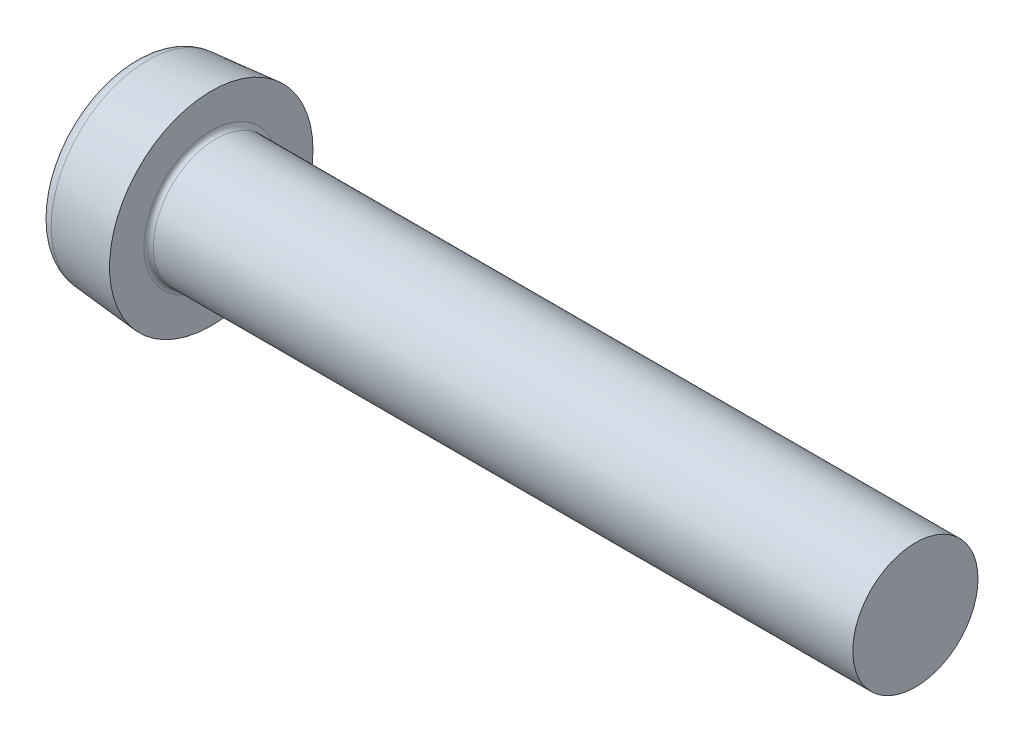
ISO-10303-21;
HEADER;
FILE_DESCRIPTION(('STEP AP214'),'2;1');
FILE_NAME('part.step','',(''),(''),'','','');
FILE_SCHEMA(('AUTOMOTIVE_DESIGN { 1 0 10303 214 1 1 1 1 }'));
ENDSEC;
DATA;
#1=APPLICATION_CONTEXT('core data for automotive mechanical design processes');
#2=APPLICATION_PROTOCOL_DEFINITION('international standard','automotive_design',2000,#1);
#3=PRODUCT_CONTEXT('',#1,'mechanical');
#4=PRODUCT('Part','Part','',(#3));
#5=PRODUCT_RELATED_PRODUCT_CATEGORY('part','',(#4));
#6=PRODUCT_DEFINITION_FORMATION('','',#4);
#7=PRODUCT_DEFINITION_CONTEXT('part definition',#1,'design');
#8=PRODUCT_DEFINITION('design','',#6,#7);
#9=PRODUCT_DEFINITION_SHAPE('','',#8);
#10=(LENGTH_UNIT() NAMED_UNIT(*) SI_UNIT(.MILLI.,.METRE.));
#11=(NAMED_UNIT(*) PLANE_ANGLE_UNIT() SI_UNIT($,.RADIAN.));
#12=(NAMED_UNIT(*) SI_UNIT($,.STERADIAN.) SOLID_ANGLE_UNIT());
#13=UNCERTAINTY_MEASURE_WITH_UNIT(LENGTH_MEASURE(1.E-05),#10,'distance_accuracy_value','');
#14=(GEOMETRIC_REPRESENTATION_CONTEXT(3) GLOBAL_UNCERTAINTY_ASSIGNED_CONTEXT((#13)) GLOBAL_UNIT_ASSIGNED_CONTEXT((#10,
#11,#12)) REPRESENTATION_CONTEXT('',''));
#15=CARTESIAN_POINT('',(0.,0.,0.));
#16=DIRECTION('',(0.,0.,1.));
#17=DIRECTION('',(1.,0.,0.));
#18=AXIS2_PLACEMENT_3D('',#15,#16,#17);
#19=CARTESIAN_POINT('',(0.,0.,0.));
#20=DIRECTION('',(-1.,0.,0.));
#21=DIRECTION('',(0.,0.,1.));
#22=AXIS2_PLACEMENT_3D('',#19,#20,#21);
#23=PLANE('',#22);
#24=CARTESIAN_POINT('',(0.,0.,0.));
#25=DIRECTION('',(-1.,0.,0.));
#26=DIRECTION('',(0.,0.,1.));
#27=AXIS2_PLACEMENT_3D('',#24,#25,#26);
#28=CIRCLE('',#27,5.14622550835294);
#29=CARTESIAN_POINT('',(0.,0.,5.14622550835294));
#30=VERTEX_POINT('',#29);
#31=EDGE_CURVE('E364',#30,#30,#28,.T.);
#32=ORIENTED_EDGE('',*,*,#31,.T.);
#33=EDGE_LOOP('',(#32));
#34=FACE_BOUND('',#33,.T.);
#35=DIRECTION('',(0.,0.,1.));
#36=VECTOR('',#35,1.);
#37=CARTESIAN_POINT('',(0.,0.77,-0.77));
#38=LINE('',#37,#36);
#39=CARTESIAN_POINT('',(0.,0.77,-3.85));
#40=VERTEX_POINT('',#39);
#41=CARTESIAN_POINT('',(0.,0.77,-1.81196017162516));
#42=VERTEX_POINT('',#41);
#43=EDGE_CURVE('E221',#40,#42,#38,.T.);
#44=ORIENTED_EDGE('',*,*,#43,.T.);
#45=DIRECTION('',(0.,0.906307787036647,-0.422618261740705));
#46=VECTOR('',#45,1.);
#47=CARTESIAN_POINT('',(0.,2.72236110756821,-2.72236110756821));
#48=LINE('',#47,#46);
#49=CARTESIAN_POINT('',(0.,2.72236110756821,-2.72236110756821));
#50=VERTEX_POINT('',#49);
#51=EDGE_CURVE('E201',#42,#50,#48,.T.);
#52=ORIENTED_EDGE('',*,*,#51,.T.);
#53=DIRECTION('',(0.,-0.422618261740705,0.906307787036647));
#54=VECTOR('',#53,1.);
#55=CARTESIAN_POINT('',(0.,2.72236110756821,-2.72236110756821));
#56=LINE('',#55,#54);
#57=CARTESIAN_POINT('',(0.,1.81196017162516,-0.77));
#58=VERTEX_POINT('',#57);
#59=EDGE_CURVE('E211',#50,#58,#56,.T.);
#60=ORIENTED_EDGE('',*,*,#59,.T.);
#61=DIRECTION('',(0.,1.,0.));
#62=VECTOR('',#61,1.);
#63=CARTESIAN_POINT('',(0.,0.77,-0.77));
#64=LINE('',#63,#62);
#65=CARTESIAN_POINT('',(0.,3.85,-0.77));
#66=VERTEX_POINT('',#65);
#67=EDGE_CURVE('E312',#58,#66,#64,.T.);
#68=ORIENTED_EDGE('',*,*,#67,.T.);
#69=DIRECTION('',(0.,0.,1.));
#70=VECTOR('',#69,1.);
#71=CARTESIAN_POINT('',(0.,3.85,-0.77));
#72=LINE('',#71,#70);
#73=CARTESIAN_POINT('',(0.,3.85,0.770000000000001));
#74=VERTEX_POINT('',#73);
#75=EDGE_CURVE('E314',#66,#74,#72,.T.);
#76=ORIENTED_EDGE('',*,*,#75,.T.);
#77=DIRECTION('',(0.,-1.,0.));
#78=VECTOR('',#77,1.);
#79=CARTESIAN_POINT('',(0.,0.77,0.77));
#80=LINE('',#79,#78);
#81=CARTESIAN_POINT('',(0.,1.81196017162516,0.77));
#82=VERTEX_POINT('',#81);
#83=EDGE_CURVE('E269',#74,#82,#80,.T.);
#84=ORIENTED_EDGE('',*,*,#83,.T.);
#85=DIRECTION('',(0.,0.422618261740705,0.906307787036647));
#86=VECTOR('',#85,1.);
#87=CARTESIAN_POINT('',(0.,2.72236110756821,2.72236110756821));
#88=LINE('',#87,#86);
#89=CARTESIAN_POINT('',(0.,2.72236110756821,2.72236110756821));
#90=VERTEX_POINT('',#89);
#91=EDGE_CURVE('E216',#82,#90,#88,.T.);
#92=ORIENTED_EDGE('',*,*,#91,.T.);
#93=DIRECTION('',(0.,-0.906307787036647,-0.422618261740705));
#94=VECTOR('',#93,1.);
#95=CARTESIAN_POINT('',(0.,2.72236110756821,2.72236110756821));
#96=LINE('',#95,#94);
#97=CARTESIAN_POINT('',(0.,0.77,1.81196017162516));
#98=VERTEX_POINT('',#97);
#99=EDGE_CURVE('E226',#90,#98,#96,.T.);
#100=ORIENTED_EDGE('',*,*,#99,.T.);
#101=DIRECTION('',(0.,0.,1.));
#102=VECTOR('',#101,1.);
#103=CARTESIAN_POINT('',(0.,0.77,0.77));
#104=LINE('',#103,#102);
#105=CARTESIAN_POINT('',(0.,0.769999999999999,3.85));
#106=VERTEX_POINT('',#105);
#107=EDGE_CURVE('E265',#98,#106,#104,.T.);
#108=ORIENTED_EDGE('',*,*,#107,.T.);
#109=DIRECTION('',(0.,-1.,0.));
#110=VECTOR('',#109,1.);
#111=CARTESIAN_POINT('',(0.,0.769999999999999,3.85));
#112=LINE('',#111,#110);
#113=CARTESIAN_POINT('',(0.,-0.770000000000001,3.85));
#114=VERTEX_POINT('',#113);
#115=EDGE_CURVE('E293',#106,#114,#112,.T.);
#116=ORIENTED_EDGE('',*,*,#115,.T.);
#117=DIRECTION('',(0.,0.,-1.));
#118=VECTOR('',#117,1.);
#119=CARTESIAN_POINT('',(0.,-0.77,0.769999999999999));
#120=LINE('',#119,#118);
#121=CARTESIAN_POINT('',(0.,-0.770000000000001,1.81196017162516));
#122=VERTEX_POINT('',#121);
#123=EDGE_CURVE('E296',#114,#122,#120,.T.);
#124=ORIENTED_EDGE('',*,*,#123,.T.);
#125=DIRECTION('',(0.,-0.906307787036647,0.422618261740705));
#126=VECTOR('',#125,1.);
#127=CARTESIAN_POINT('',(0.,-2.72236110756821,2.72236110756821));
#128=LINE('',#127,#126);
#129=CARTESIAN_POINT('',(0.,-2.72236110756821,2.72236110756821));
#130=VERTEX_POINT('',#129);
#131=EDGE_CURVE('E229',#122,#130,#128,.T.);
#132=ORIENTED_EDGE('',*,*,#131,.T.);
#133=DIRECTION('',(0.,0.422618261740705,-0.906307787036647));
#134=VECTOR('',#133,1.);
#135=CARTESIAN_POINT('',(0.,-2.72236110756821,2.72236110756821));
#136=LINE('',#135,#134);
#137=CARTESIAN_POINT('',(0.,-1.81196017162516,0.769999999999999));
#138=VERTEX_POINT('',#137);
#139=EDGE_CURVE('E232',#130,#138,#136,.T.);
#140=ORIENTED_EDGE('',*,*,#139,.T.);
#141=DIRECTION('',(0.,-1.,0.));
#142=VECTOR('',#141,1.);
#143=CARTESIAN_POINT('',(0.,-0.77,0.769999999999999));
#144=LINE('',#143,#142);
#145=CARTESIAN_POINT('',(0.,-3.85,0.769999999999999));
#146=VERTEX_POINT('',#145);
#147=EDGE_CURVE('E299',#138,#146,#144,.T.);
#148=ORIENTED_EDGE('',*,*,#147,.T.);
#149=DIRECTION('',(0.,0.,-1.));
#150=VECTOR('',#149,1.);
#151=CARTESIAN_POINT('',(0.,-3.85,-0.77));
#152=LINE('',#151,#150);
#153=CARTESIAN_POINT('',(0.,-3.85,-0.77));
#154=VERTEX_POINT('',#153);
#155=EDGE_CURVE('E301',#146,#154,#152,.T.);
#156=ORIENTED_EDGE('',*,*,#155,.T.);
#157=DIRECTION('',(0.,1.,0.));
#158=VECTOR('',#157,1.);
#159=CARTESIAN_POINT('',(0.,-0.77,-0.77));
#160=LINE('',#159,#158);
#161=CARTESIAN_POINT('',(0.,-1.81196017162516,-0.77));
#162=VERTEX_POINT('',#161);
#163=EDGE_CURVE('E304',#154,#162,#160,.T.);
#164=ORIENTED_EDGE('',*,*,#163,.T.);
#165=DIRECTION('',(0.,-0.422618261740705,-0.906307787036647));
#166=VECTOR('',#165,1.);
#167=CARTESIAN_POINT('',(0.,-2.72236110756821,-2.72236110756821));
#168=LINE('',#167,#166);
#169=CARTESIAN_POINT('',(0.,-2.72236110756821,-2.72236110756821));
#170=VERTEX_POINT('',#169);
#171=EDGE_CURVE('E235',#162,#170,#168,.T.);
#172=ORIENTED_EDGE('',*,*,#171,.T.);
#173=DIRECTION('',(0.,0.906307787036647,0.422618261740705));
#174=VECTOR('',#173,1.);
#175=CARTESIAN_POINT('',(0.,-2.72236110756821,-2.72236110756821));
#176=LINE('',#175,#174);
#177=CARTESIAN_POINT('',(0.,-0.77,-1.81196017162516));
#178=VERTEX_POINT('',#177);
#179=EDGE_CURVE('E238',#170,#178,#176,.T.);
#180=ORIENTED_EDGE('',*,*,#179,.T.);
#181=DIRECTION('',(0.,0.,-1.));
#182=VECTOR('',#181,1.);
#183=CARTESIAN_POINT('',(0.,-0.77,-0.77));
#184=LINE('',#183,#182);
#185=CARTESIAN_POINT('',(0.,-0.77,-3.85));
#186=VERTEX_POINT('',#185);
#187=EDGE_CURVE('E307',#178,#186,#184,.T.);
#188=ORIENTED_EDGE('',*,*,#187,.T.);
#189=DIRECTION('',(0.,1.,0.));
#190=VECTOR('',#189,1.);
#191=CARTESIAN_POINT('',(0.,0.77,-3.85));
#192=LINE('',#191,#190);
#193=EDGE_CURVE('E309',#186,#40,#192,.T.);
#194=ORIENTED_EDGE('',*,*,#193,.T.);
#195=EDGE_LOOP('',(#44,#52,#60,#68,#76,#84,#92,#100,#108,#116,#124,#132,#140,#148,#156,#164,
#172,#180,#188,#194));
#196=FACE_BOUND('',#195,.T.);
#197=ADVANCED_FACE('F37',(#34,#196),#23,.T.);
#198=CARTESIAN_POINT('',(5.,0.77,0.77));
#199=DIRECTION('',(0.,-1.,0.));
#200=DIRECTION('',(0.,0.,-1.));
#201=AXIS2_PLACEMENT_3D('',#198,#199,#200);
#202=PLANE('',#201);
#203=ORIENTED_EDGE('',*,*,#107,.F.);
#204=DIRECTION('',(-0.927964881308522,0.,0.372667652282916));
#205=VECTOR('',#204,1.);
#206=CARTESIAN_POINT('',(4.6659273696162,0.77,-0.061860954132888));
#207=LINE('',#206,#205);
#208=CARTESIAN_POINT('',(1.84752547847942,0.77,1.07));
#209=VERTEX_POINT('',#208);
#210=EDGE_CURVE('E247',#98,#209,#207,.F.);
#211=ORIENTED_EDGE('',*,*,#210,.T.);
#212=DIRECTION('',(-1.,0.,0.));
#213=VECTOR('',#212,1.);
#214=CARTESIAN_POINT('',(5.,0.77,1.07));
#215=LINE('',#214,#213);
#216=CARTESIAN_POINT('',(5.,0.77,1.07));
#217=VERTEX_POINT('',#216);
#218=EDGE_CURVE('E346',#209,#217,#215,.F.);
#219=ORIENTED_EDGE('',*,*,#218,.T.);
#220=DIRECTION('',(0.,0.,1.));
#221=VECTOR('',#220,1.);
#222=CARTESIAN_POINT('',(5.,0.77,0.77));
#223=LINE('',#222,#221);
#224=CARTESIAN_POINT('',(5.,0.77,2.03014882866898));
#225=VERTEX_POINT('',#224);
#226=EDGE_CURVE('E266',#217,#225,#223,.T.);
#227=ORIENTED_EDGE('',*,*,#226,.T.);
#228=DIRECTION('',(-0.939692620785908,0.,0.342020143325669));
#229=VECTOR('',#228,1.);
#230=CARTESIAN_POINT('',(0.,0.769999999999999,3.85));
#231=LINE('',#230,#229);
#232=EDGE_CURVE('E324',#225,#106,#231,.T.);
#233=ORIENTED_EDGE('',*,*,#232,.T.);
#234=EDGE_LOOP('',(#203,#211,#219,#227,#233));
#235=FACE_BOUND('',#234,.T.);
#236=ADVANCED_FACE('F486',(#235),#202,.T.);
#237=CARTESIAN_POINT('',(5.,-0.77,0.769999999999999));
#238=DIRECTION('',(0.,1.,0.));
#239=DIRECTION('',(0.,0.,1.));
#240=AXIS2_PLACEMENT_3D('',#237,#238,#239);
#241=PLANE('',#240);
#242=DIRECTION('',(-1.,0.,0.));
#243=VECTOR('',#242,1.);
#244=CARTESIAN_POINT('',(5.,-0.77,1.07));
#245=LINE('',#244,#243);
#246=CARTESIAN_POINT('',(5.,-0.77,1.07));
#247=VERTEX_POINT('',#246);
#248=CARTESIAN_POINT('',(1.84752547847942,-0.77,1.07));
#249=VERTEX_POINT('',#248);
#250=EDGE_CURVE('E333',#247,#249,#245,.T.);
#251=ORIENTED_EDGE('',*,*,#250,.T.);
#252=DIRECTION('',(0.927964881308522,0.,-0.372667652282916));
#253=VECTOR('',#252,1.);
#254=CARTESIAN_POINT('',(4.6659273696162,-0.77,-0.0618609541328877));
#255=LINE('',#254,#253);
#256=EDGE_CURVE('E262',#249,#122,#255,.F.);
#257=ORIENTED_EDGE('',*,*,#256,.T.);
#258=ORIENTED_EDGE('',*,*,#123,.F.);
#259=DIRECTION('',(-0.939692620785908,0.,0.342020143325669));
#260=VECTOR('',#259,1.);
#261=CARTESIAN_POINT('',(5.40500402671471,-0.770000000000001,1.88273941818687));
#262=LINE('',#261,#260);
#263=CARTESIAN_POINT('',(5.,-0.770000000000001,2.03014882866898));
#264=VERTEX_POINT('',#263);
#265=EDGE_CURVE('E368',#264,#114,#262,.T.);
#266=ORIENTED_EDGE('',*,*,#265,.F.);
#267=DIRECTION('',(0.,0.,-1.));
#268=VECTOR('',#267,1.);
#269=CARTESIAN_POINT('',(5.,-0.77,0.769999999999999));
#270=LINE('',#269,#268);
#271=EDGE_CURVE('E270',#264,#247,#270,.T.);
#272=ORIENTED_EDGE('',*,*,#271,.T.);
#273=EDGE_LOOP('',(#251,#257,#258,#266,#272));
#274=FACE_BOUND('',#273,.T.);
#275=ADVANCED_FACE('F420',(#274),#241,.T.);
#276=CARTESIAN_POINT('',(5.,-0.77,0.769999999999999));
#277=DIRECTION('',(0.,0.,-1.));
#278=DIRECTION('',(0.,1.,0.));
#279=AXIS2_PLACEMENT_3D('',#276,#277,#278);
#280=PLANE('',#279);
#281=ORIENTED_EDGE('',*,*,#147,.F.);
#282=DIRECTION('',(-0.927964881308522,-0.372667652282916,0.));
#283=VECTOR('',#282,1.);
#284=CARTESIAN_POINT('',(4.6659273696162,0.0618609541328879,0.77));
#285=LINE('',#284,#283);
#286=CARTESIAN_POINT('',(1.84752547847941,-1.07,0.769999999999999));
#287=VERTEX_POINT('',#286);
#288=EDGE_CURVE('E259',#138,#287,#285,.F.);
#289=ORIENTED_EDGE('',*,*,#288,.T.);
#290=DIRECTION('',(-1.,0.,0.));
#291=VECTOR('',#290,1.);
#292=CARTESIAN_POINT('',(5.,-1.07,0.769999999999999));
#293=LINE('',#292,#291);
#294=CARTESIAN_POINT('',(5.,-1.07,0.769999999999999));
#295=VERTEX_POINT('',#294);
#296=EDGE_CURVE('E336',#287,#295,#293,.F.);
#297=ORIENTED_EDGE('',*,*,#296,.T.);
#298=DIRECTION('',(0.,-1.,0.));
#299=VECTOR('',#298,1.);
#300=CARTESIAN_POINT('',(5.,-0.77,0.769999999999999));
#301=LINE('',#300,#299);
#302=CARTESIAN_POINT('',(5.,-2.03014882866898,0.769999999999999));
#303=VERTEX_POINT('',#302);
#304=EDGE_CURVE('E273',#295,#303,#301,.T.);
#305=ORIENTED_EDGE('',*,*,#304,.T.);
#306=DIRECTION('',(-0.939692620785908,-0.342020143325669,0.));
#307=VECTOR('',#306,1.);
#308=CARTESIAN_POINT('',(0.,-3.85,0.769999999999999));
#309=LINE('',#308,#307);
#310=EDGE_CURVE('E370',#303,#146,#309,.T.);
#311=ORIENTED_EDGE('',*,*,#310,.T.);
#312=EDGE_LOOP('',(#281,#289,#297,#305,#311));
#313=FACE_BOUND('',#312,.T.);
#314=ADVANCED_FACE('F412',(#313),#280,.T.);
#315=CARTESIAN_POINT('',(5.,-0.77,-0.77));
#316=DIRECTION('',(0.,0.,1.));
#317=DIRECTION('',(0.,-1.,0.));
#318=AXIS2_PLACEMENT_3D('',#315,#316,#317);
#319=PLANE('',#318);
#320=DIRECTION('',(-1.,0.,0.));
#321=VECTOR('',#320,1.);
#322=CARTESIAN_POINT('',(5.,-1.07,-0.77));
#323=LINE('',#322,#321);
#324=CARTESIAN_POINT('',(5.,-1.07,-0.77));
#325=VERTEX_POINT('',#324);
#326=CARTESIAN_POINT('',(1.84752547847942,-1.07,-0.77));
#327=VERTEX_POINT('',#326);
#328=EDGE_CURVE('E338',#325,#327,#323,.T.);
#329=ORIENTED_EDGE('',*,*,#328,.T.);
#330=DIRECTION('',(0.927964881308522,0.372667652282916,0.));
#331=VECTOR('',#330,1.);
#332=CARTESIAN_POINT('',(4.6659273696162,0.0618609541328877,-0.77));
#333=LINE('',#332,#331);
#334=EDGE_CURVE('E256',#327,#162,#333,.F.);
#335=ORIENTED_EDGE('',*,*,#334,.T.);
#336=ORIENTED_EDGE('',*,*,#163,.F.);
#337=DIRECTION('',(-0.939692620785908,-0.342020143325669,0.));
#338=VECTOR('',#337,1.);
#339=CARTESIAN_POINT('',(5.40500402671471,-1.88273941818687,-0.77));
#340=LINE('',#339,#338);
#341=CARTESIAN_POINT('',(5.,-2.03014882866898,-0.77));
#342=VERTEX_POINT('',#341);
#343=EDGE_CURVE('E385',#342,#154,#340,.T.);
#344=ORIENTED_EDGE('',*,*,#343,.F.);
#345=DIRECTION('',(0.,1.,0.));
#346=VECTOR('',#345,1.);
#347=CARTESIAN_POINT('',(5.,-0.77,-0.77));
#348=LINE('',#347,#346);
#349=EDGE_CURVE('E276',#342,#325,#348,.T.);
#350=ORIENTED_EDGE('',*,*,#349,.T.);
#351=EDGE_LOOP('',(#329,#335,#336,#344,#350));
#352=FACE_BOUND('',#351,.T.);
#353=ADVANCED_FACE('F434',(#352),#319,.T.);
#354=CARTESIAN_POINT('',(5.,-0.77,-0.77));
#355=DIRECTION('',(0.,1.,0.));
#356=DIRECTION('',(0.,0.,1.));
#357=AXIS2_PLACEMENT_3D('',#354,#355,#356);
#358=PLANE('',#357);
#359=ORIENTED_EDGE('',*,*,#187,.F.);
#360=DIRECTION('',(-0.927964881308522,0.,-0.372667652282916));
#361=VECTOR('',#360,1.);
#362=CARTESIAN_POINT('',(4.6659273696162,-0.77,0.061860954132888));
#363=LINE('',#362,#361);
#364=CARTESIAN_POINT('',(1.84752547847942,-0.77,-1.07));
#365=VERTEX_POINT('',#364);
#366=EDGE_CURVE('E253',#178,#365,#363,.F.);
#367=ORIENTED_EDGE('',*,*,#366,.T.);
#368=DIRECTION('',(-1.,0.,0.));
#369=VECTOR('',#368,1.);
#370=CARTESIAN_POINT('',(5.,-0.77,-1.07));
#371=LINE('',#370,#369);
#372=CARTESIAN_POINT('',(5.,-0.77,-1.07));
#373=VERTEX_POINT('',#372);
#374=EDGE_CURVE('E341',#365,#373,#371,.F.);
#375=ORIENTED_EDGE('',*,*,#374,.T.);
#376=DIRECTION('',(0.,0.,-1.));
#377=VECTOR('',#376,1.);
#378=CARTESIAN_POINT('',(5.,-0.77,-0.77));
#379=LINE('',#378,#377);
#380=CARTESIAN_POINT('',(5.,-0.77,-2.03014882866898));
#381=VERTEX_POINT('',#380);
#382=EDGE_CURVE('E279',#373,#381,#379,.T.);
#383=ORIENTED_EDGE('',*,*,#382,.T.);
#384=DIRECTION('',(-0.939692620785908,0.,-0.342020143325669));
#385=VECTOR('',#384,1.);
#386=CARTESIAN_POINT('',(0.,-0.77,-3.85));
#387=LINE('',#386,#385);
#388=EDGE_CURVE('E381',#381,#186,#387,.T.);
#389=ORIENTED_EDGE('',*,*,#388,.T.);
#390=EDGE_LOOP('',(#359,#367,#375,#383,#389));
#391=FACE_BOUND('',#390,.T.);
#392=ADVANCED_FACE('F441',(#391),#358,.T.);
#393=CARTESIAN_POINT('',(5.,0.77,-0.77));
#394=DIRECTION('',(0.,-1.,0.));
#395=DIRECTION('',(0.,0.,-1.));
#396=AXIS2_PLACEMENT_3D('',#393,#394,#395);
#397=PLANE('',#396);
#398=DIRECTION('',(-1.,0.,0.));
#399=VECTOR('',#398,1.);
#400=CARTESIAN_POINT('',(5.,0.77,-1.07));
#401=LINE('',#400,#399);
#402=CARTESIAN_POINT('',(5.,0.77,-1.07));
#403=VERTEX_POINT('',#402);
#404=CARTESIAN_POINT('',(1.84752547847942,0.77,-1.07));
#405=VERTEX_POINT('',#404);
#406=EDGE_CURVE('E348',#403,#405,#401,.T.);
#407=ORIENTED_EDGE('',*,*,#406,.T.);
#408=DIRECTION('',(0.927964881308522,0.,0.372667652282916));
#409=VECTOR('',#408,1.);
#410=CARTESIAN_POINT('',(4.6659273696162,0.77,0.0618609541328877));
#411=LINE('',#410,#409);
#412=EDGE_CURVE('E245',#405,#42,#411,.F.);
#413=ORIENTED_EDGE('',*,*,#412,.T.);
#414=ORIENTED_EDGE('',*,*,#43,.F.);
#415=DIRECTION('',(-0.939692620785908,0.,-0.342020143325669));
#416=VECTOR('',#415,1.);
#417=CARTESIAN_POINT('',(5.40500402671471,0.77,-1.88273941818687));
#418=LINE('',#417,#416);
#419=CARTESIAN_POINT('',(5.,0.77,-2.03014882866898));
#420=VERTEX_POINT('',#419);
#421=EDGE_CURVE('E379',#420,#40,#418,.T.);
#422=ORIENTED_EDGE('',*,*,#421,.F.);
#423=DIRECTION('',(0.,0.,1.));
#424=VECTOR('',#423,1.);
#425=CARTESIAN_POINT('',(5.,0.77,-0.77));
#426=LINE('',#425,#424);
#427=EDGE_CURVE('E282',#420,#403,#426,.T.);
#428=ORIENTED_EDGE('',*,*,#427,.T.);
#429=EDGE_LOOP('',(#407,#413,#414,#422,#428));
#430=FACE_BOUND('',#429,.T.);
#431=ADVANCED_FACE('F455',(#430),#397,.T.);
#432=CARTESIAN_POINT('',(5.,0.77,-0.77));
#433=DIRECTION('',(0.,0.,1.));
#434=DIRECTION('',(0.,-1.,0.));
#435=AXIS2_PLACEMENT_3D('',#432,#433,#434);
#436=PLANE('',#435);
#437=ORIENTED_EDGE('',*,*,#67,.F.);
#438=DIRECTION('',(-0.927964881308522,0.372667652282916,0.));
#439=VECTOR('',#438,1.);
#440=CARTESIAN_POINT('',(4.6659273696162,-0.061860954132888,-0.77));
#441=LINE('',#440,#439);
#442=CARTESIAN_POINT('',(1.84752547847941,1.07,-0.77));
#443=VERTEX_POINT('',#442);
#444=EDGE_CURVE('E207',#58,#443,#441,.F.);
#445=ORIENTED_EDGE('',*,*,#444,.T.);
#446=DIRECTION('',(-1.,0.,0.));
#447=VECTOR('',#446,1.);
#448=CARTESIAN_POINT('',(5.,1.07,-0.77));
#449=LINE('',#448,#447);
#450=CARTESIAN_POINT('',(5.,1.07,-0.77));
#451=VERTEX_POINT('',#450);
#452=EDGE_CURVE('E351',#443,#451,#449,.F.);
#453=ORIENTED_EDGE('',*,*,#452,.T.);
#454=DIRECTION('',(0.,1.,0.));
#455=VECTOR('',#454,1.);
#456=CARTESIAN_POINT('',(5.,0.77,-0.77));
#457=LINE('',#456,#455);
#458=CARTESIAN_POINT('',(5.,2.03014882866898,-0.77));
#459=VERTEX_POINT('',#458);
#460=EDGE_CURVE('E285',#451,#459,#457,.T.);
#461=ORIENTED_EDGE('',*,*,#460,.T.);
#462=DIRECTION('',(-0.939692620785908,0.342020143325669,0.));
#463=VECTOR('',#462,1.);
#464=CARTESIAN_POINT('',(0.,3.85,-0.77));
#465=LINE('',#464,#463);
#466=EDGE_CURVE('E375',#459,#66,#465,.T.);
#467=ORIENTED_EDGE('',*,*,#466,.T.);
#468=EDGE_LOOP('',(#437,#445,#453,#461,#467));
#469=FACE_BOUND('',#468,.T.);
#470=ADVANCED_FACE('F462',(#469),#436,.T.);
#471=CARTESIAN_POINT('',(5.,0.77,0.77));
#472=DIRECTION('',(0.,0.,-1.));
#473=DIRECTION('',(0.,1.,0.));
#474=AXIS2_PLACEMENT_3D('',#471,#472,#473);
#475=PLANE('',#474);
#476=DIRECTION('',(-1.,0.,0.));
#477=VECTOR('',#476,1.);
#478=CARTESIAN_POINT('',(5.,1.07,0.77));
#479=LINE('',#478,#477);
#480=CARTESIAN_POINT('',(5.,1.07,0.77));
#481=VERTEX_POINT('',#480);
#482=CARTESIAN_POINT('',(1.84752547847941,1.07,0.77));
#483=VERTEX_POINT('',#482);
#484=EDGE_CURVE('E343',#481,#483,#479,.T.);
#485=ORIENTED_EDGE('',*,*,#484,.T.);
#486=DIRECTION('',(0.927964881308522,-0.372667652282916,0.));
#487=VECTOR('',#486,1.);
#488=CARTESIAN_POINT('',(4.6659273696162,-0.0618609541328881,0.77));
#489=LINE('',#488,#487);
#490=EDGE_CURVE('E250',#483,#82,#489,.F.);
#491=ORIENTED_EDGE('',*,*,#490,.T.);
#492=ORIENTED_EDGE('',*,*,#83,.F.);
#493=DIRECTION('',(-0.939692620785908,0.342020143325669,0.));
#494=VECTOR('',#493,1.);
#495=CARTESIAN_POINT('',(5.40500402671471,1.88273941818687,0.77));
#496=LINE('',#495,#494);
#497=CARTESIAN_POINT('',(5.,2.03014882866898,0.77));
#498=VERTEX_POINT('',#497);
#499=EDGE_CURVE('E291',#498,#74,#496,.T.);
#500=ORIENTED_EDGE('',*,*,#499,.F.);
#501=DIRECTION('',(0.,-1.,0.));
#502=VECTOR('',#501,1.);
#503=CARTESIAN_POINT('',(5.,0.77,0.77));
#504=LINE('',#503,#502);
#505=EDGE_CURVE('E288',#498,#481,#504,.T.);
#506=ORIENTED_EDGE('',*,*,#505,.T.);
#507=EDGE_LOOP('',(#485,#491,#492,#500,#506));
#508=FACE_BOUND('',#507,.T.);
#509=ADVANCED_FACE('F472',(#508),#475,.T.);
#510=CARTESIAN_POINT('',(5.,-1.07,1.07));
#511=DIRECTION('',(-1.,0.,0.));
#512=DIRECTION('',(0.,0.,1.));
#513=AXIS2_PLACEMENT_3D('',#510,#511,#512);
#514=CYLINDRICAL_SURFACE('',#513,0.3);
#515=CARTESIAN_POINT('',(2.19586571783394,-1.07,1.07));
#516=DIRECTION('',(0.342020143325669,-0.851650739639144,-0.397131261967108));
#517=DIRECTION('',(-0.939692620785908,-0.309975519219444,-0.144543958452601));
#518=AXIS2_PLACEMENT_3D('',#515,#516,#517);
#519=ELLIPSE('',#518,0.877141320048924,0.3);
#520=CARTESIAN_POINT('',(2.47777350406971,-0.857867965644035,0.857867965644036));
#521=VERTEX_POINT('',#520);
#522=EDGE_CURVE('E45',#287,#521,#519,.T.);
#523=ORIENTED_EDGE('',*,*,#522,.T.);
#524=CARTESIAN_POINT('',(2.19586571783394,-1.07,1.07));
#525=DIRECTION('',(0.342020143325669,0.397131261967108,0.851650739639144));
#526=DIRECTION('',(-0.939692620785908,0.144543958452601,0.309975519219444));
#527=AXIS2_PLACEMENT_3D('',#524,#525,#526);
#528=ELLIPSE('',#527,0.877141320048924,0.3);
#529=EDGE_CURVE('E11',#521,#249,#528,.T.);
#530=ORIENTED_EDGE('',*,*,#529,.T.);
#531=ORIENTED_EDGE('',*,*,#250,.F.);
#532=CARTESIAN_POINT('',(5.,-1.07,1.07));
#533=DIRECTION('',(1.,0.,0.));
#534=DIRECTION('',(0.,0.,-1.));
#535=AXIS2_PLACEMENT_3D('',#532,#533,#534);
#536=CIRCLE('',#535,0.3);
#537=EDGE_CURVE('E353',#295,#247,#536,.T.);
#538=ORIENTED_EDGE('',*,*,#537,.F.);
#539=ORIENTED_EDGE('',*,*,#296,.F.);
#540=EDGE_LOOP('',(#523,#530,#531,#538,#539));
#541=FACE_BOUND('',#540,.T.);
#542=ADVANCED_FACE('F406',(#541),#514,.T.);
#543=CARTESIAN_POINT('',(5.,-1.07,-1.07));
#544=DIRECTION('',(-1.,0.,0.));
#545=DIRECTION('',(0.,0.,1.));
#546=AXIS2_PLACEMENT_3D('',#543,#544,#545);
#547=CYLINDRICAL_SURFACE('',#546,0.3);
#548=CARTESIAN_POINT('',(2.19586571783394,-1.07,-1.07));
#549=DIRECTION('',(0.342020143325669,0.397131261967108,-0.851650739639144));
#550=DIRECTION('',(-0.939692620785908,0.144543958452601,-0.309975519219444));
#551=AXIS2_PLACEMENT_3D('',#548,#549,#550);
#552=ELLIPSE('',#551,0.877141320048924,0.3);
#553=CARTESIAN_POINT('',(2.47777350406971,-0.857867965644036,-0.857867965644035));
#554=VERTEX_POINT('',#553);
#555=EDGE_CURVE('E398',#365,#554,#552,.T.);
#556=ORIENTED_EDGE('',*,*,#555,.T.);
#557=CARTESIAN_POINT('',(2.19586571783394,-1.07,-1.07));
#558=DIRECTION('',(0.342020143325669,-0.851650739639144,0.397131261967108));
#559=DIRECTION('',(-0.939692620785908,-0.309975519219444,0.144543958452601));
#560=AXIS2_PLACEMENT_3D('',#557,#558,#559);
#561=ELLIPSE('',#560,0.877141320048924,0.3);
#562=EDGE_CURVE('E401',#554,#327,#561,.T.);
#563=ORIENTED_EDGE('',*,*,#562,.T.);
#564=ORIENTED_EDGE('',*,*,#328,.F.);
#565=CARTESIAN_POINT('',(5.,-1.07,-1.07));
#566=DIRECTION('',(1.,0.,0.));
#567=DIRECTION('',(0.,0.,-1.));
#568=AXIS2_PLACEMENT_3D('',#565,#566,#567);
#569=CIRCLE('',#568,0.3);
#570=EDGE_CURVE('E355',#373,#325,#569,.T.);
#571=ORIENTED_EDGE('',*,*,#570,.F.);
#572=ORIENTED_EDGE('',*,*,#374,.F.);
#573=EDGE_LOOP('',(#556,#563,#564,#571,#572));
#574=FACE_BOUND('',#573,.T.);
#575=ADVANCED_FACE('F445',(#574),#547,.T.);
#576=CARTESIAN_POINT('',(5.,1.07,1.07));
#577=DIRECTION('',(-1.,0.,0.));
#578=DIRECTION('',(0.,0.,1.));
#579=AXIS2_PLACEMENT_3D('',#576,#577,#578);
#580=CYLINDRICAL_SURFACE('',#579,0.3);
#581=CARTESIAN_POINT('',(2.19586571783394,1.07,1.07));
#582=DIRECTION('',(0.342020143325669,-0.397131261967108,0.851650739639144));
#583=DIRECTION('',(-0.939692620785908,-0.144543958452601,0.309975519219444));
#584=AXIS2_PLACEMENT_3D('',#581,#582,#583);
#585=ELLIPSE('',#584,0.877141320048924,0.3);
#586=CARTESIAN_POINT('',(2.47777350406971,0.857867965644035,0.857867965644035));
#587=VERTEX_POINT('',#586);
#588=EDGE_CURVE('E392',#209,#587,#585,.T.);
#589=ORIENTED_EDGE('',*,*,#588,.T.);
#590=CARTESIAN_POINT('',(2.19586571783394,1.07,1.07));
#591=DIRECTION('',(0.342020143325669,0.851650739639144,-0.397131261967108));
#592=DIRECTION('',(-0.939692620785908,0.309975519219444,-0.144543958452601));
#593=AXIS2_PLACEMENT_3D('',#590,#591,#592);
#594=ELLIPSE('',#593,0.877141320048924,0.3);
#595=EDGE_CURVE('E395',#587,#483,#594,.T.);
#596=ORIENTED_EDGE('',*,*,#595,.T.);
#597=ORIENTED_EDGE('',*,*,#484,.F.);
#598=CARTESIAN_POINT('',(5.,1.07,1.07));
#599=DIRECTION('',(1.,0.,0.));
#600=DIRECTION('',(0.,0.,-1.));
#601=AXIS2_PLACEMENT_3D('',#598,#599,#600);
#602=CIRCLE('',#601,0.3);
#603=EDGE_CURVE('E357',#217,#481,#602,.T.);
#604=ORIENTED_EDGE('',*,*,#603,.F.);
#605=ORIENTED_EDGE('',*,*,#218,.F.);
#606=EDGE_LOOP('',(#589,#596,#597,#604,#605));
#607=FACE_BOUND('',#606,.T.);
#608=ADVANCED_FACE('F478',(#607),#580,.T.);
#609=CARTESIAN_POINT('',(5.,1.07,-1.07));
#610=DIRECTION('',(-1.,0.,0.));
#611=DIRECTION('',(0.,0.,1.));
#612=AXIS2_PLACEMENT_3D('',#609,#610,#611);
#613=CYLINDRICAL_SURFACE('',#612,0.3);
#614=CARTESIAN_POINT('',(2.19586571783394,1.07,-1.07));
#615=DIRECTION('',(0.342020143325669,0.851650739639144,0.397131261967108));
#616=DIRECTION('',(-0.939692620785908,0.309975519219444,0.144543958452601));
#617=AXIS2_PLACEMENT_3D('',#614,#615,#616);
#618=ELLIPSE('',#617,0.877141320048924,0.3);
#619=CARTESIAN_POINT('',(2.47777350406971,0.857867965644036,-0.857867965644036));
#620=VERTEX_POINT('',#619);
#621=EDGE_CURVE('E367',#443,#620,#618,.T.);
#622=ORIENTED_EDGE('',*,*,#621,.T.);
#623=CARTESIAN_POINT('',(2.19586571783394,1.07,-1.07));
#624=DIRECTION('',(0.342020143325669,-0.397131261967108,-0.851650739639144));
#625=DIRECTION('',(-0.939692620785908,-0.144543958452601,-0.309975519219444));
#626=AXIS2_PLACEMENT_3D('',#623,#624,#625);
#627=ELLIPSE('',#626,0.877141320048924,0.3);
#628=EDGE_CURVE('E204',#620,#405,#627,.T.);
#629=ORIENTED_EDGE('',*,*,#628,.T.);
#630=ORIENTED_EDGE('',*,*,#406,.F.);
#631=CARTESIAN_POINT('',(5.,1.07,-1.07));
#632=DIRECTION('',(1.,0.,0.));
#633=DIRECTION('',(0.,0.,-1.));
#634=AXIS2_PLACEMENT_3D('',#631,#632,#633);
#635=CIRCLE('',#634,0.3);
#636=EDGE_CURVE('E359',#451,#403,#635,.T.);
#637=ORIENTED_EDGE('',*,*,#636,.F.);
#638=ORIENTED_EDGE('',*,*,#452,.F.);
#639=EDGE_LOOP('',(#622,#629,#630,#637,#638));
#640=FACE_BOUND('',#639,.T.);
#641=ADVANCED_FACE('F458',(#640),#613,.T.);
#642=CARTESIAN_POINT('',(50.,4.00000000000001,0.));
#643=DIRECTION('',(1.,0.,0.));
#644=DIRECTION('',(0.,0.,-1.));
#645=AXIS2_PLACEMENT_3D('',#642,#643,#644);
#646=PLANE('',#645);
#647=CARTESIAN_POINT('',(50.,0.,0.));
#648=DIRECTION('',(1.,0.,0.));
#649=DIRECTION('',(0.,0.,-1.));
#650=AXIS2_PLACEMENT_3D('',#647,#648,#649);
#651=CIRCLE('',#650,4.00000000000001);
#652=CARTESIAN_POINT('',(50.,0.,-4.00000000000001));
#653=VERTEX_POINT('',#652);
#654=EDGE_CURVE('E330',#653,#653,#651,.T.);
#655=ORIENTED_EDGE('',*,*,#654,.T.);
#656=EDGE_LOOP('',(#655));
#657=FACE_BOUND('',#656,.T.);
#658=ADVANCED_FACE('F522',(#657),#646,.T.);
#659=CARTESIAN_POINT('',(4.51581291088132,0.,0.));
#660=DIRECTION('',(1.,0.,0.));
#661=DIRECTION('',(0.,0.,-1.));
#662=AXIS2_PLACEMENT_3D('',#659,#660,#661);
#663=CYLINDRICAL_SURFACE('',#662,4.);
#664=CARTESIAN_POINT('',(5.3,0.,0.));
#665=DIRECTION('',(1.,0.,0.));
#666=DIRECTION('',(0.,0.,-1.));
#667=AXIS2_PLACEMENT_3D('',#664,#665,#666);
#668=CIRCLE('',#667,4.);
#669=CARTESIAN_POINT('',(5.3,0.,-4.));
#670=VERTEX_POINT('',#669);
#671=EDGE_CURVE('E327',#670,#670,#668,.T.);
#672=ORIENTED_EDGE('',*,*,#671,.T.);
#673=EDGE_LOOP('',(#672));
#674=FACE_BOUND('',#673,.T.);
#675=ORIENTED_EDGE('',*,*,#654,.F.);
#676=EDGE_LOOP('',(#675));
#677=FACE_BOUND('',#676,.T.);
#678=ADVANCED_FACE('F518',(#674,#677),#663,.T.);
#679=CARTESIAN_POINT('',(5.3,0.,0.));
#680=DIRECTION('',(1.,0.,0.));
#681=DIRECTION('',(0.,0.,-1.));
#682=AXIS2_PLACEMENT_3D('',#679,#680,#681);
#683=TOROIDAL_SURFACE('',#682,4.3,0.299999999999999);
#684=CARTESIAN_POINT('',(5.,0.,0.));
#685=DIRECTION('',(1.,0.,0.));
#686=DIRECTION('',(0.,0.,-1.));
#687=AXIS2_PLACEMENT_3D('',#684,#685,#686);
#688=CIRCLE('',#687,4.3);
#689=CARTESIAN_POINT('',(5.,0.,-4.3));
#690=VERTEX_POINT('',#689);
#691=EDGE_CURVE('E323',#690,#690,#688,.T.);
#692=ORIENTED_EDGE('',*,*,#691,.T.);
#693=EDGE_LOOP('',(#692));
#694=FACE_BOUND('',#693,.T.);
#695=ORIENTED_EDGE('',*,*,#671,.F.);
#696=EDGE_LOOP('',(#695));
#697=FACE_BOUND('',#696,.T.);
#698=ADVANCED_FACE('F514',(#694,#697),#683,.F.);
#699=CARTESIAN_POINT('',(5.,4.3,0.));
#700=DIRECTION('',(1.,0.,0.));
#701=DIRECTION('',(0.,0.,-1.));
#702=AXIS2_PLACEMENT_3D('',#699,#700,#701);
#703=PLANE('',#702);
#704=CARTESIAN_POINT('',(5.,0.,0.));
#705=DIRECTION('',(1.,0.,0.));
#706=DIRECTION('',(0.,0.,-1.));
#707=AXIS2_PLACEMENT_3D('',#704,#705,#706);
#708=CIRCLE('',#707,6.5);
#709=CARTESIAN_POINT('',(5.,0.,-6.5));
#710=VERTEX_POINT('',#709);
#711=EDGE_CURVE('E319',#710,#710,#708,.T.);
#712=ORIENTED_EDGE('',*,*,#711,.T.);
#713=EDGE_LOOP('',(#712));
#714=FACE_BOUND('',#713,.T.);
#715=ORIENTED_EDGE('',*,*,#691,.F.);
#716=EDGE_LOOP('',(#715));
#717=FACE_BOUND('',#716,.T.);
#718=ADVANCED_FACE('F499',(#714,#717),#703,.T.);
#719=CARTESIAN_POINT('',(5.,0.,0.));
#720=DIRECTION('',(1.,0.,0.));
#721=DIRECTION('',(0.,0.,-1.));
#722=AXIS2_PLACEMENT_3D('',#719,#720,#721);
#723=CONICAL_SURFACE('',#722,6.5,0.0872664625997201);
#724=CARTESIAN_POINT('',(0.912844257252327,0.,0.));
#725=DIRECTION('',(-1.,0.,0.));
#726=DIRECTION('',(0.,0.,1.));
#727=AXIS2_PLACEMENT_3D('',#724,#725,#726);
#728=CIRCLE('',#727,6.14242020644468);
#729=CARTESIAN_POINT('',(0.912844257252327,0.,6.14242020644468));
#730=VERTEX_POINT('',#729);
#731=EDGE_CURVE('E361',#730,#730,#728,.F.);
#732=ORIENTED_EDGE('',*,*,#731,.T.);
#733=EDGE_LOOP('',(#732));
#734=FACE_BOUND('',#733,.T.);
#735=ORIENTED_EDGE('',*,*,#711,.F.);
#736=EDGE_LOOP('',(#735));
#737=FACE_BOUND('',#736,.T.);
#738=ADVANCED_FACE('F492',(#734,#737),#723,.T.);
#739=CARTESIAN_POINT('',(0.,0.769999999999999,3.85));
#740=DIRECTION('',(-0.342020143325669,0.,-0.939692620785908));
#741=DIRECTION('',(-0.939692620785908,0.,0.342020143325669));
#742=AXIS2_PLACEMENT_3D('',#739,#740,#741);
#743=PLANE('',#742);
#744=ORIENTED_EDGE('',*,*,#115,.F.);
#745=ORIENTED_EDGE('',*,*,#232,.F.);
#746=DIRECTION('',(0.,-1.,0.));
#747=VECTOR('',#746,1.);
#748=CARTESIAN_POINT('',(5.,0.77,2.03014882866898));
#749=LINE('',#748,#747);
#750=EDGE_CURVE('E268',#225,#264,#749,.T.);
#751=ORIENTED_EDGE('',*,*,#750,.T.);
#752=ORIENTED_EDGE('',*,*,#265,.T.);
#753=EDGE_LOOP('',(#744,#745,#751,#752));
#754=FACE_BOUND('',#753,.T.);
#755=ADVANCED_FACE('F490',(#754),#743,.T.);
#756=CARTESIAN_POINT('',(0.,-3.85,-0.77));
#757=DIRECTION('',(-0.342020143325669,0.939692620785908,0.));
#758=DIRECTION('',(-0.939692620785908,-0.342020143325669,0.));
#759=AXIS2_PLACEMENT_3D('',#756,#757,#758);
#760=PLANE('',#759);
#761=ORIENTED_EDGE('',*,*,#155,.F.);
#762=ORIENTED_EDGE('',*,*,#310,.F.);
#763=DIRECTION('',(0.,0.,-1.));
#764=VECTOR('',#763,1.);
#765=CARTESIAN_POINT('',(5.,-2.03014882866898,-0.77));
#766=LINE('',#765,#764);
#767=EDGE_CURVE('E275',#303,#342,#766,.T.);
#768=ORIENTED_EDGE('',*,*,#767,.T.);
#769=ORIENTED_EDGE('',*,*,#343,.T.);
#770=EDGE_LOOP('',(#761,#762,#768,#769));
#771=FACE_BOUND('',#770,.T.);
#772=ADVANCED_FACE('F430',(#771),#760,.T.);
#773=CARTESIAN_POINT('',(0.,0.77,-3.85));
#774=DIRECTION('',(-0.342020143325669,0.,0.939692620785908));
#775=DIRECTION('',(0.939692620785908,0.,0.342020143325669));
#776=AXIS2_PLACEMENT_3D('',#773,#774,#775);
#777=PLANE('',#776);
#778=ORIENTED_EDGE('',*,*,#193,.F.);
#779=ORIENTED_EDGE('',*,*,#388,.F.);
#780=DIRECTION('',(0.,1.,0.));
#781=VECTOR('',#780,1.);
#782=CARTESIAN_POINT('',(5.,0.77,-2.03014882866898));
#783=LINE('',#782,#781);
#784=EDGE_CURVE('E281',#381,#420,#783,.T.);
#785=ORIENTED_EDGE('',*,*,#784,.T.);
#786=ORIENTED_EDGE('',*,*,#421,.T.);
#787=EDGE_LOOP('',(#778,#779,#785,#786));
#788=FACE_BOUND('',#787,.T.);
#789=ADVANCED_FACE('F452',(#788),#777,.T.);
#790=CARTESIAN_POINT('',(0.,3.85,-0.77));
#791=DIRECTION('',(-0.342020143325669,-0.939692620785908,0.));
#792=DIRECTION('',(0.939692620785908,-0.342020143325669,0.));
#793=AXIS2_PLACEMENT_3D('',#790,#791,#792);
#794=PLANE('',#793);
#795=ORIENTED_EDGE('',*,*,#75,.F.);
#796=ORIENTED_EDGE('',*,*,#466,.F.);
#797=DIRECTION('',(0.,0.,1.));
#798=VECTOR('',#797,1.);
#799=CARTESIAN_POINT('',(5.,2.03014882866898,-0.77));
#800=LINE('',#799,#798);
#801=EDGE_CURVE('E287',#459,#498,#800,.T.);
#802=ORIENTED_EDGE('',*,*,#801,.T.);
#803=ORIENTED_EDGE('',*,*,#499,.T.);
#804=EDGE_LOOP('',(#795,#796,#802,#803));
#805=FACE_BOUND('',#804,.T.);
#806=ADVANCED_FACE('F39',(#805),#794,.T.);
#807=CARTESIAN_POINT('',(5.,0.769999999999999,0.77));
#808=DIRECTION('',(1.,0.,0.));
#809=DIRECTION('',(0.,0.,-1.));
#810=AXIS2_PLACEMENT_3D('',#807,#808,#809);
#811=PLANE('',#810);
#812=ORIENTED_EDGE('',*,*,#226,.F.);
#813=ORIENTED_EDGE('',*,*,#603,.T.);
#814=ORIENTED_EDGE('',*,*,#505,.F.);
#815=ORIENTED_EDGE('',*,*,#801,.F.);
#816=ORIENTED_EDGE('',*,*,#460,.F.);
#817=ORIENTED_EDGE('',*,*,#636,.T.);
#818=ORIENTED_EDGE('',*,*,#427,.F.);
#819=ORIENTED_EDGE('',*,*,#784,.F.);
#820=ORIENTED_EDGE('',*,*,#382,.F.);
#821=ORIENTED_EDGE('',*,*,#570,.T.);
#822=ORIENTED_EDGE('',*,*,#349,.F.);
#823=ORIENTED_EDGE('',*,*,#767,.F.);
#824=ORIENTED_EDGE('',*,*,#304,.F.);
#825=ORIENTED_EDGE('',*,*,#537,.T.);
#826=ORIENTED_EDGE('',*,*,#271,.F.);
#827=ORIENTED_EDGE('',*,*,#750,.F.);
#828=EDGE_LOOP('',(#812,#813,#814,#815,#816,#817,#818,#819,#820,#821,#822,#823,#824,#825,#826,#827));
#829=FACE_BOUND('',#828,.T.);
#830=ADVANCED_FACE('F425',(#829),#811,.F.);
#831=CARTESIAN_POINT('',(1.,0.,0.));
#832=DIRECTION('',(-1.,0.,0.));
#833=DIRECTION('',(0.,0.,1.));
#834=AXIS2_PLACEMENT_3D('',#831,#832,#833);
#835=TOROIDAL_SURFACE('',#834,5.14622550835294,1.);
#836=ORIENTED_EDGE('',*,*,#31,.F.);
#837=EDGE_LOOP('',(#836));
#838=FACE_BOUND('',#837,.T.);
#839=ORIENTED_EDGE('',*,*,#731,.F.);
#840=EDGE_LOOP('',(#839));
#841=FACE_BOUND('',#840,.T.);
#842=ADVANCED_FACE('F534',(#838,#841),#835,.T.);
#843=CARTESIAN_POINT('',(0.,2.72236110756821,-2.72236110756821));
#844=DIRECTION('',(0.342020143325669,0.851650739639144,0.397131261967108));
#845=DIRECTION('',(0.,-0.422618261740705,0.906307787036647));
#846=AXIS2_PLACEMENT_3D('',#843,#844,#845);
#847=PLANE('',#846);
#848=ORIENTED_EDGE('',*,*,#59,.F.);
#849=DIRECTION('',(-0.684791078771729,0.515296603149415,-0.515296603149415));
#850=VECTOR('',#849,1.);
#851=CARTESIAN_POINT('',(0.,2.72236110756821,-2.72236110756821));
#852=LINE('',#851,#850);
#853=EDGE_CURVE('E197',#620,#50,#852,.T.);
#854=ORIENTED_EDGE('',*,*,#853,.F.);
#855=ORIENTED_EDGE('',*,*,#621,.F.);
#856=ORIENTED_EDGE('',*,*,#444,.F.);
#857=EDGE_LOOP('',(#848,#854,#855,#856));
#858=FACE_BOUND('',#857,.T.);
#859=ADVANCED_FACE('F212',(#858),#847,.F.);
#860=CARTESIAN_POINT('',(0.,2.72236110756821,-2.72236110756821));
#861=DIRECTION('',(0.342020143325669,-0.397131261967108,-0.851650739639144));
#862=DIRECTION('',(0.,0.906307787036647,-0.422618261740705));
#863=AXIS2_PLACEMENT_3D('',#860,#861,#862);
#864=PLANE('',#863);
#865=ORIENTED_EDGE('',*,*,#628,.F.);
#866=ORIENTED_EDGE('',*,*,#853,.T.);
#867=ORIENTED_EDGE('',*,*,#51,.F.);
#868=ORIENTED_EDGE('',*,*,#412,.F.);
#869=EDGE_LOOP('',(#865,#866,#867,#868));
#870=FACE_BOUND('',#869,.T.);
#871=ADVANCED_FACE('F199',(#870),#864,.F.);
#872=CARTESIAN_POINT('',(0.,2.72236110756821,2.72236110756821));
#873=DIRECTION('',(0.342020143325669,-0.397131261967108,0.851650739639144));
#874=DIRECTION('',(0.,-0.906307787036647,-0.422618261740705));
#875=AXIS2_PLACEMENT_3D('',#872,#873,#874);
#876=PLANE('',#875);
#877=ORIENTED_EDGE('',*,*,#99,.F.);
#878=DIRECTION('',(-0.684791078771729,0.515296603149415,0.515296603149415));
#879=VECTOR('',#878,1.);
#880=CARTESIAN_POINT('',(0.,2.72236110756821,2.72236110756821));
#881=LINE('',#880,#879);
#882=EDGE_CURVE('E208',#587,#90,#881,.T.);
#883=ORIENTED_EDGE('',*,*,#882,.F.);
#884=ORIENTED_EDGE('',*,*,#588,.F.);
#885=ORIENTED_EDGE('',*,*,#210,.F.);
#886=EDGE_LOOP('',(#877,#883,#884,#885));
#887=FACE_BOUND('',#886,.T.);
#888=ADVANCED_FACE('F483',(#887),#876,.F.);
#889=CARTESIAN_POINT('',(0.,2.72236110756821,2.72236110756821));
#890=DIRECTION('',(0.342020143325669,0.851650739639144,-0.397131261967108));
#891=DIRECTION('',(0.,0.422618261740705,0.906307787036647));
#892=AXIS2_PLACEMENT_3D('',#889,#890,#891);
#893=PLANE('',#892);
#894=ORIENTED_EDGE('',*,*,#595,.F.);
#895=ORIENTED_EDGE('',*,*,#882,.T.);
#896=ORIENTED_EDGE('',*,*,#91,.F.);
#897=ORIENTED_EDGE('',*,*,#490,.F.);
#898=EDGE_LOOP('',(#894,#895,#896,#897));
#899=FACE_BOUND('',#898,.T.);
#900=ADVANCED_FACE('F476',(#899),#893,.F.);
#901=CARTESIAN_POINT('',(0.,-2.72236110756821,-2.72236110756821));
#902=DIRECTION('',(0.342020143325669,0.397131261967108,-0.851650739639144));
#903=DIRECTION('',(0.,0.906307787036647,0.422618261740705));
#904=AXIS2_PLACEMENT_3D('',#901,#902,#903);
#905=PLANE('',#904);
#906=ORIENTED_EDGE('',*,*,#179,.F.);
#907=DIRECTION('',(-0.684791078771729,-0.515296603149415,-0.515296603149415));
#908=VECTOR('',#907,1.);
#909=CARTESIAN_POINT('',(0.,-2.72236110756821,-2.72236110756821));
#910=LINE('',#909,#908);
#911=EDGE_CURVE('E60',#554,#170,#910,.T.);
#912=ORIENTED_EDGE('',*,*,#911,.F.);
#913=ORIENTED_EDGE('',*,*,#555,.F.);
#914=ORIENTED_EDGE('',*,*,#366,.F.);
#915=EDGE_LOOP('',(#906,#912,#913,#914));
#916=FACE_BOUND('',#915,.T.);
#917=ADVANCED_FACE('F438',(#916),#905,.F.);
#918=CARTESIAN_POINT('',(0.,-2.72236110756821,-2.72236110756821));
#919=DIRECTION('',(0.342020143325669,-0.851650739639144,0.397131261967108));
#920=DIRECTION('',(0.,-0.422618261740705,-0.906307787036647));
#921=AXIS2_PLACEMENT_3D('',#918,#919,#920);
#922=PLANE('',#921);
#923=ORIENTED_EDGE('',*,*,#562,.F.);
#924=ORIENTED_EDGE('',*,*,#911,.T.);
#925=ORIENTED_EDGE('',*,*,#171,.F.);
#926=ORIENTED_EDGE('',*,*,#334,.F.);
#927=EDGE_LOOP('',(#923,#924,#925,#926));
#928=FACE_BOUND('',#927,.T.);
#929=ADVANCED_FACE('F437',(#928),#922,.F.);
#930=CARTESIAN_POINT('',(0.,-2.72236110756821,2.72236110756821));
#931=DIRECTION('',(0.342020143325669,0.397131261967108,0.851650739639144));
#932=DIRECTION('',(0.,-0.906307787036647,0.422618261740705));
#933=AXIS2_PLACEMENT_3D('',#930,#931,#932);
#934=PLANE('',#933);
#935=ORIENTED_EDGE('',*,*,#529,.F.);
#936=DIRECTION('',(-0.684791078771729,-0.515296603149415,0.515296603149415));
#937=VECTOR('',#936,1.);
#938=CARTESIAN_POINT('',(0.,-2.72236110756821,2.72236110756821));
#939=LINE('',#938,#937);
#940=EDGE_CURVE('E52',#521,#130,#939,.T.);
#941=ORIENTED_EDGE('',*,*,#940,.T.);
#942=ORIENTED_EDGE('',*,*,#131,.F.);
#943=ORIENTED_EDGE('',*,*,#256,.F.);
#944=EDGE_LOOP('',(#935,#941,#942,#943));
#945=FACE_BOUND('',#944,.T.);
#946=ADVANCED_FACE('F418',(#945),#934,.F.);
#947=CARTESIAN_POINT('',(0.,-2.72236110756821,2.72236110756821));
#948=DIRECTION('',(0.342020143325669,-0.851650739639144,-0.397131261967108));
#949=DIRECTION('',(0.,0.422618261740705,-0.906307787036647));
#950=AXIS2_PLACEMENT_3D('',#947,#948,#949);
#951=PLANE('',#950);
#952=ORIENTED_EDGE('',*,*,#139,.F.);
#953=ORIENTED_EDGE('',*,*,#940,.F.);
#954=ORIENTED_EDGE('',*,*,#522,.F.);
#955=ORIENTED_EDGE('',*,*,#288,.F.);
#956=EDGE_LOOP('',(#952,#953,#954,#955));
#957=FACE_BOUND('',#956,.T.);
#958=ADVANCED_FACE('F409',(#957),#951,.F.);
#959=CLOSED_SHELL('',(#197,#236,#275,#314,#353,#392,#431,#470,#509,#542,#575,#608,#641,#658,
#678,#698,#718,#738,#755,#772,#789,#806,#830,#842,#859,#871,#888,#900,#917,#929,#946,#958));
#960=MANIFOLD_SOLID_BREP('B2',#959);
#961=ADVANCED_BREP_SHAPE_REPRESENTATION('',(#18,#960),#14);
#962=SHAPE_DEFINITION_REPRESENTATION(#9,#961);
ENDSEC;
END-ISO-10303-21;
